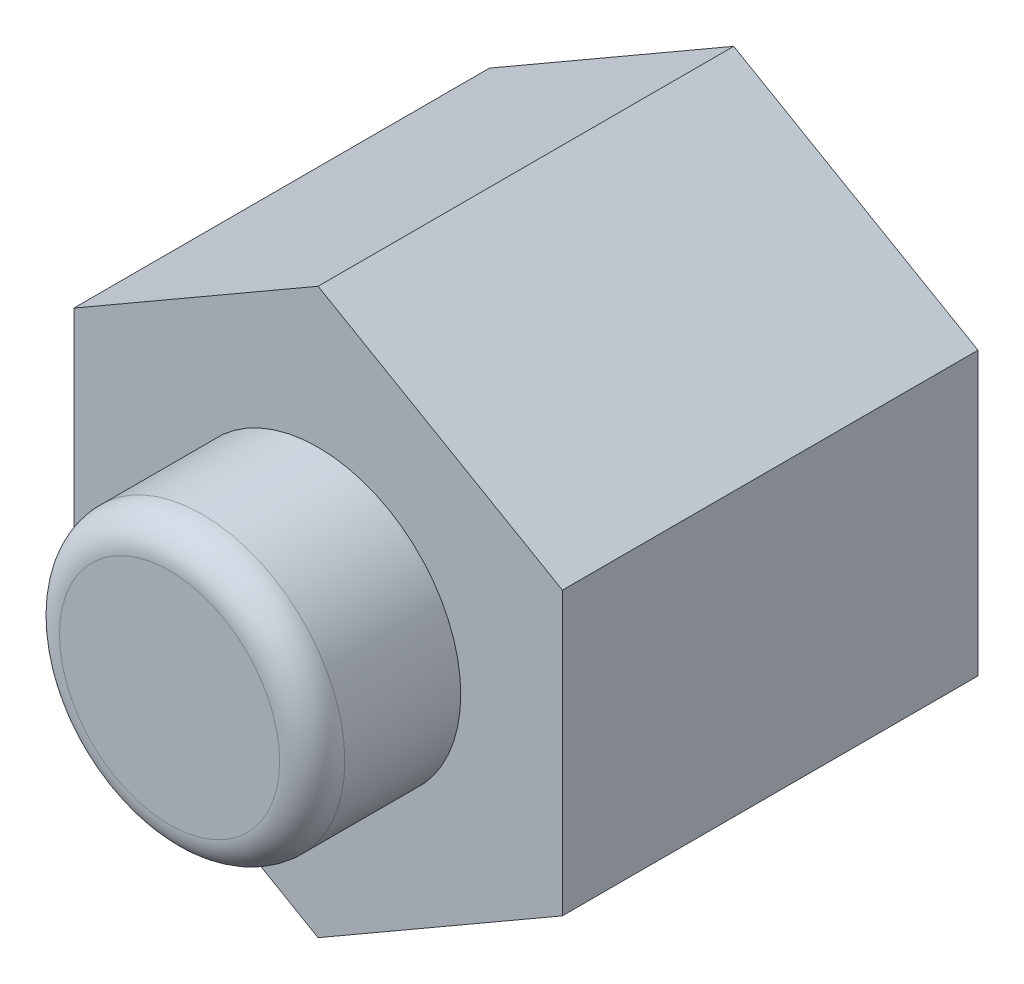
ISO-10303-21;
HEADER;
FILE_DESCRIPTION(('STEP AP214'),'2;1');
FILE_NAME('part.step','',(''),(''),'','','');
FILE_SCHEMA(('AUTOMOTIVE_DESIGN { 1 0 10303 214 1 1 1 1 }'));
ENDSEC;
DATA;
#1=APPLICATION_CONTEXT('core data for automotive mechanical design processes');
#2=APPLICATION_PROTOCOL_DEFINITION('international standard','automotive_design',2000,#1);
#3=PRODUCT_CONTEXT('',#1,'mechanical');
#4=PRODUCT('Part','Part','',(#3));
#5=PRODUCT_RELATED_PRODUCT_CATEGORY('part','',(#4));
#6=PRODUCT_DEFINITION_FORMATION('','',#4);
#7=PRODUCT_DEFINITION_CONTEXT('part definition',#1,'design');
#8=PRODUCT_DEFINITION('design','',#6,#7);
#9=PRODUCT_DEFINITION_SHAPE('','',#8);
#10=(LENGTH_UNIT() NAMED_UNIT(*) SI_UNIT(.MILLI.,.METRE.));
#11=(NAMED_UNIT(*) PLANE_ANGLE_UNIT() SI_UNIT($,.RADIAN.));
#12=(NAMED_UNIT(*) SI_UNIT($,.STERADIAN.) SOLID_ANGLE_UNIT());
#13=UNCERTAINTY_MEASURE_WITH_UNIT(LENGTH_MEASURE(1.E-05),#10,'distance_accuracy_value','');
#14=(GEOMETRIC_REPRESENTATION_CONTEXT(3) GLOBAL_UNCERTAINTY_ASSIGNED_CONTEXT((#13)) GLOBAL_UNIT_ASSIGNED_CONTEXT((#10,
#11,#12)) REPRESENTATION_CONTEXT('',''));
#15=CARTESIAN_POINT('',(0.,0.,0.));
#16=DIRECTION('',(0.,0.,1.));
#17=DIRECTION('',(1.,0.,0.));
#18=AXIS2_PLACEMENT_3D('',#15,#16,#17);
#19=CARTESIAN_POINT('',(0.,0.,24.7141999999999));
#20=DIRECTION('',(0.,0.,1.));
#21=DIRECTION('',(1.,0.,0.));
#22=AXIS2_PLACEMENT_3D('',#19,#20,#21);
#23=PLANE('',#22);
#24=CARTESIAN_POINT('',(0.,0.,24.7141999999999));
#25=DIRECTION('',(0.,0.,-1.));
#26=DIRECTION('',(-1.,0.,0.));
#27=AXIS2_PLACEMENT_3D('',#24,#25,#26);
#28=CIRCLE('',#27,4.2926);
#29=CARTESIAN_POINT('',(-4.2926,0.,24.7141999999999));
#30=VERTEX_POINT('',#29);
#31=CARTESIAN_POINT('',(4.29260000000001,0.,24.7141999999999));
#32=VERTEX_POINT('',#31);
#33=EDGE_CURVE('E78',#30,#32,#28,.T.);
#34=ORIENTED_EDGE('',*,*,#33,.F.);
#35=CARTESIAN_POINT('',(0.,0.,24.7141999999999));
#36=DIRECTION('',(0.,0.,-1.));
#37=DIRECTION('',(1.,0.,0.));
#38=AXIS2_PLACEMENT_3D('',#35,#36,#37);
#39=CIRCLE('',#38,4.29260000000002);
#40=EDGE_CURVE('E76',#32,#30,#39,.T.);
#41=ORIENTED_EDGE('',*,*,#40,.F.);
#42=EDGE_LOOP('',(#34,#41));
#43=FACE_BOUND('',#42,.T.);
#44=ADVANCED_FACE('F17',(#43),#23,.T.);
#45=CARTESIAN_POINT('',(0.,0.,12.7));
#46=DIRECTION('',(0.,0.,-1.));
#47=DIRECTION('',(-1.,0.,0.));
#48=AXIS2_PLACEMENT_3D('',#45,#46,#47);
#49=PLANE('',#48);
#50=CARTESIAN_POINT('',(0.,0.,12.7));
#51=DIRECTION('',(0.,0.,-1.));
#52=DIRECTION('',(-1.,0.,0.));
#53=AXIS2_PLACEMENT_3D('',#50,#51,#52);
#54=CIRCLE('',#53,3.17500000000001);
#55=CARTESIAN_POINT('',(-3.17500000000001,0.,12.7));
#56=VERTEX_POINT('',#55);
#57=EDGE_CURVE('E84',#56,#56,#54,.T.);
#58=ORIENTED_EDGE('',*,*,#57,.T.);
#59=EDGE_LOOP('',(#58));
#60=FACE_BOUND('',#59,.T.);
#61=ADVANCED_FACE('F112',(#60),#49,.T.);
#62=CARTESIAN_POINT('',(0.,0.,23.4441999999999));
#63=DIRECTION('',(0.,0.,1.));
#64=DIRECTION('',(1.,0.,0.));
#65=AXIS2_PLACEMENT_3D('',#62,#63,#64);
#66=TOROIDAL_SURFACE('',#65,4.2926,1.27);
#67=ORIENTED_EDGE('',*,*,#40,.T.);
#68=ORIENTED_EDGE('',*,*,#33,.T.);
#69=EDGE_LOOP('',(#67,#68));
#70=FACE_BOUND('',#69,.T.);
#71=CARTESIAN_POINT('',(0.,0.,23.4441999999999));
#72=DIRECTION('',(0.,0.,-1.));
#73=DIRECTION('',(-1.,0.,0.));
#74=AXIS2_PLACEMENT_3D('',#71,#72,#73);
#75=CIRCLE('',#74,5.56260000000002);
#76=CARTESIAN_POINT('',(-5.56260000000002,0.,23.4441999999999));
#77=VERTEX_POINT('',#76);
#78=EDGE_CURVE('E106',#77,#77,#75,.T.);
#79=ORIENTED_EDGE('',*,*,#78,.F.);
#80=EDGE_LOOP('',(#79));
#81=FACE_BOUND('',#80,.T.);
#82=ADVANCED_FACE('F80',(#70,#81),#66,.T.);
#83=CARTESIAN_POINT('',(0.,0.,12.7));
#84=DIRECTION('',(0.,0.,-1.));
#85=DIRECTION('',(-1.,0.,0.));
#86=AXIS2_PLACEMENT_3D('',#83,#84,#85);
#87=CYLINDRICAL_SURFACE('',#86,3.17500000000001);
#88=ORIENTED_EDGE('',*,*,#57,.F.);
#89=EDGE_LOOP('',(#88));
#90=FACE_BOUND('',#89,.T.);
#91=CARTESIAN_POINT('',(0.,0.,0.));
#92=DIRECTION('',(0.,0.,-1.));
#93=DIRECTION('',(-1.,0.,0.));
#94=AXIS2_PLACEMENT_3D('',#91,#92,#93);
#95=CIRCLE('',#94,3.17500000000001);
#96=CARTESIAN_POINT('',(-3.17500000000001,0.,0.));
#97=VERTEX_POINT('',#96);
#98=EDGE_CURVE('E136',#97,#97,#95,.T.);
#99=ORIENTED_EDGE('',*,*,#98,.T.);
#100=EDGE_LOOP('',(#99));
#101=FACE_BOUND('',#100,.T.);
#102=ADVANCED_FACE('F111',(#90,#101),#87,.F.);
#103=CARTESIAN_POINT('',(0.,0.,24.7141999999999));
#104=DIRECTION('',(0.,0.,-1.));
#105=DIRECTION('',(-1.,0.,0.));
#106=AXIS2_PLACEMENT_3D('',#103,#104,#105);
#107=CYLINDRICAL_SURFACE('',#106,5.56260000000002);
#108=CARTESIAN_POINT('',(0.,0.,18.9229999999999));
#109=DIRECTION('',(0.,0.,-1.));
#110=DIRECTION('',(-1.,0.,0.));
#111=AXIS2_PLACEMENT_3D('',#108,#109,#110);
#112=CIRCLE('',#111,5.56260000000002);
#113=CARTESIAN_POINT('',(-5.56260000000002,0.,18.9229999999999));
#114=VERTEX_POINT('',#113);
#115=EDGE_CURVE('E133',#114,#114,#112,.T.);
#116=ORIENTED_EDGE('',*,*,#115,.F.);
#117=EDGE_LOOP('',(#116));
#118=FACE_BOUND('',#117,.T.);
#119=ORIENTED_EDGE('',*,*,#78,.T.);
#120=EDGE_LOOP('',(#119));
#121=FACE_BOUND('',#120,.T.);
#122=ADVANCED_FACE('F145',(#118,#121),#107,.T.);
#123=CARTESIAN_POINT('',(0.,0.,0.));
#124=DIRECTION('',(0.,0.,1.));
#125=DIRECTION('',(1.,0.,0.));
#126=AXIS2_PLACEMENT_3D('',#123,#124,#125);
#127=PLANE('',#126);
#128=ORIENTED_EDGE('',*,*,#98,.F.);
#129=EDGE_LOOP('',(#128));
#130=FACE_BOUND('',#129,.T.);
#131=CARTESIAN_POINT('',(0.,0.,0.));
#132=DIRECTION('',(0.,0.,1.));
#133=DIRECTION('',(1.,0.,0.));
#134=AXIS2_PLACEMENT_3D('',#131,#132,#133);
#135=CIRCLE('',#134,4.4222045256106);
#136=CARTESIAN_POINT('',(4.4222045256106,0.,0.));
#137=VERTEX_POINT('',#136);
#138=EDGE_CURVE('E129',#137,#137,#135,.T.);
#139=ORIENTED_EDGE('',*,*,#138,.F.);
#140=EDGE_LOOP('',(#139));
#141=FACE_BOUND('',#140,.T.);
#142=ADVANCED_FACE('F147',(#130,#141),#127,.F.);
#143=CARTESIAN_POINT('',(0.,0.,18.9229999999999));
#144=DIRECTION('',(0.,0.,1.));
#145=DIRECTION('',(1.,0.,0.));
#146=AXIS2_PLACEMENT_3D('',#143,#144,#145);
#147=PLANE('',#146);
#148=DIRECTION('',(-0.866025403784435,-0.500000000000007,0.));
#149=VECTOR('',#148,1.);
#150=CARTESIAN_POINT('',(0.,-10.9985226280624,18.9229999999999));
#151=LINE('',#150,#149);
#152=CARTESIAN_POINT('',(0.,-10.9985226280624,18.9229999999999));
#153=VERTEX_POINT('',#152);
#154=CARTESIAN_POINT('',(9.52500000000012,-5.49926131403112,18.9229999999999));
#155=VERTEX_POINT('',#154);
#156=EDGE_CURVE('E215',#153,#155,#151,.F.);
#157=ORIENTED_EDGE('',*,*,#156,.T.);
#158=DIRECTION('',(0.,-1.,0.));
#159=VECTOR('',#158,1.);
#160=CARTESIAN_POINT('',(9.52500000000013,-5.49926131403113,18.9229999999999));
#161=LINE('',#160,#159);
#162=CARTESIAN_POINT('',(9.52500000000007,5.4992613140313,18.9229999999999));
#163=VERTEX_POINT('',#162);
#164=EDGE_CURVE('E217',#155,#163,#161,.F.);
#165=ORIENTED_EDGE('',*,*,#164,.T.);
#166=DIRECTION('',(0.866025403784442,-0.499999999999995,0.));
#167=VECTOR('',#166,1.);
#168=CARTESIAN_POINT('',(9.52500000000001,5.49926131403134,18.9229999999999));
#169=LINE('',#168,#167);
#170=CARTESIAN_POINT('',(0.,10.9985226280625,18.9229999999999));
#171=VERTEX_POINT('',#170);
#172=EDGE_CURVE('E132',#163,#171,#169,.F.);
#173=ORIENTED_EDGE('',*,*,#172,.T.);
#174=DIRECTION('',(0.866025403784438,0.500000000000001,0.));
#175=VECTOR('',#174,1.);
#176=CARTESIAN_POINT('',(0.,10.9985226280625,18.9229999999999));
#177=LINE('',#176,#175);
#178=CARTESIAN_POINT('',(-9.52500000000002,5.49926131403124,18.9229999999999));
#179=VERTEX_POINT('',#178);
#180=EDGE_CURVE('E250',#171,#179,#177,.F.);
#181=ORIENTED_EDGE('',*,*,#180,.T.);
#182=DIRECTION('',(0.,1.,0.));
#183=VECTOR('',#182,1.);
#184=CARTESIAN_POINT('',(-9.52500000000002,5.49926131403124,18.9229999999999));
#185=LINE('',#184,#183);
#186=CARTESIAN_POINT('',(-9.525,-5.49926131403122,18.9229999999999));
#187=VERTEX_POINT('',#186);
#188=EDGE_CURVE('E245',#179,#187,#185,.F.);
#189=ORIENTED_EDGE('',*,*,#188,.T.);
#190=DIRECTION('',(-0.866025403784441,0.499999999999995,0.));
#191=VECTOR('',#190,1.);
#192=CARTESIAN_POINT('',(-9.525,-5.49926131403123,18.9229999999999));
#193=LINE('',#192,#191);
#194=EDGE_CURVE('E219',#187,#153,#193,.F.);
#195=ORIENTED_EDGE('',*,*,#194,.T.);
#196=EDGE_LOOP('',(#157,#165,#173,#181,#189,#195));
#197=FACE_BOUND('',#196,.T.);
#198=ORIENTED_EDGE('',*,*,#115,.T.);
#199=EDGE_LOOP('',(#198));
#200=FACE_BOUND('',#199,.T.);
#201=ADVANCED_FACE('F154',(#197,#200),#147,.T.);
#202=CARTESIAN_POINT('',(0.,0.,1.26999999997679));
#203=DIRECTION('',(0.,0.,1.));
#204=DIRECTION('',(1.,0.,0.));
#205=AXIS2_PLACEMENT_3D('',#202,#203,#204);
#206=CONICAL_SURFACE('',#205,4.76249999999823,0.261799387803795);
#207=ORIENTED_EDGE('',*,*,#138,.T.);
#208=EDGE_LOOP('',(#207));
#209=FACE_BOUND('',#208,.T.);
#210=CARTESIAN_POINT('',(0.,0.,1.27000000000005));
#211=DIRECTION('',(0.,0.,-1.));
#212=DIRECTION('',(-1.,0.,0.));
#213=AXIS2_PLACEMENT_3D('',#210,#211,#212);
#214=CIRCLE('',#213,4.76250000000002);
#215=CARTESIAN_POINT('',(-4.76250000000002,0.,1.27000000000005));
#216=VERTEX_POINT('',#215);
#217=EDGE_CURVE('E227',#216,#216,#214,.F.);
#218=ORIENTED_EDGE('',*,*,#217,.F.);
#219=EDGE_LOOP('',(#218));
#220=FACE_BOUND('',#219,.T.);
#221=ADVANCED_FACE('F202',(#209,#220),#206,.T.);
#222=CARTESIAN_POINT('',(9.52500000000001,5.49926131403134,18.9229999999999));
#223=DIRECTION('',(-0.499999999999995,-0.866025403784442,0.));
#224=DIRECTION('',(0.866025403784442,-0.499999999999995,0.));
#225=AXIS2_PLACEMENT_3D('',#222,#223,#224);
#226=PLANE('',#225);
#227=DIRECTION('',(-0.866025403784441,0.499999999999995,0.));
#228=VECTOR('',#227,1.);
#229=CARTESIAN_POINT('',(9.52500000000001,5.49926131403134,2.71779999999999));
#230=LINE('',#229,#228);
#231=CARTESIAN_POINT('',(9.52500000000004,5.49926131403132,2.71779999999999));
#232=VERTEX_POINT('',#231);
#233=CARTESIAN_POINT('',(0.,10.9985226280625,2.71779999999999));
#234=VERTEX_POINT('',#233);
#235=EDGE_CURVE('E231',#232,#234,#230,.T.);
#236=ORIENTED_EDGE('',*,*,#235,.T.);
#237=DIRECTION('',(0.,0.,1.));
#238=VECTOR('',#237,1.);
#239=CARTESIAN_POINT('',(0.,10.9985226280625,18.9229999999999));
#240=LINE('',#239,#238);
#241=EDGE_CURVE('E247',#234,#171,#240,.T.);
#242=ORIENTED_EDGE('',*,*,#241,.T.);
#243=ORIENTED_EDGE('',*,*,#172,.F.);
#244=DIRECTION('',(0.,0.,1.));
#245=VECTOR('',#244,1.);
#246=CARTESIAN_POINT('',(9.52500000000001,5.49926131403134,18.9229999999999));
#247=LINE('',#246,#245);
#248=EDGE_CURVE('E228',#163,#232,#247,.F.);
#249=ORIENTED_EDGE('',*,*,#248,.T.);
#250=EDGE_LOOP('',(#236,#242,#243,#249));
#251=FACE_BOUND('',#250,.T.);
#252=ADVANCED_FACE('F198',(#251),#226,.F.);
#253=CARTESIAN_POINT('',(0.,10.9985226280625,18.9229999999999));
#254=DIRECTION('',(0.500000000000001,-0.866025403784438,0.));
#255=DIRECTION('',(0.866025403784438,0.500000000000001,0.));
#256=AXIS2_PLACEMENT_3D('',#253,#254,#255);
#257=PLANE('',#256);
#258=DIRECTION('',(-0.866025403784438,-0.500000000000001,0.));
#259=VECTOR('',#258,1.);
#260=CARTESIAN_POINT('',(0.,10.9985226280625,2.71779999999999));
#261=LINE('',#260,#259);
#262=CARTESIAN_POINT('',(-9.52500000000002,5.49926131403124,2.71779999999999));
#263=VERTEX_POINT('',#262);
#264=EDGE_CURVE('E257',#234,#263,#261,.T.);
#265=ORIENTED_EDGE('',*,*,#264,.T.);
#266=DIRECTION('',(0.,0.,1.));
#267=VECTOR('',#266,1.);
#268=CARTESIAN_POINT('',(-9.52500000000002,5.49926131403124,18.9229999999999));
#269=LINE('',#268,#267);
#270=EDGE_CURVE('E242',#263,#179,#269,.T.);
#271=ORIENTED_EDGE('',*,*,#270,.T.);
#272=ORIENTED_EDGE('',*,*,#180,.F.);
#273=ORIENTED_EDGE('',*,*,#241,.F.);
#274=EDGE_LOOP('',(#265,#271,#272,#273));
#275=FACE_BOUND('',#274,.T.);
#276=ADVANCED_FACE('F194',(#275),#257,.F.);
#277=CARTESIAN_POINT('',(-9.52500000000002,5.49926131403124,18.9229999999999));
#278=DIRECTION('',(1.,0.,0.));
#279=DIRECTION('',(0.,1.,0.));
#280=AXIS2_PLACEMENT_3D('',#277,#278,#279);
#281=PLANE('',#280);
#282=DIRECTION('',(0.,1.,0.));
#283=VECTOR('',#282,1.);
#284=CARTESIAN_POINT('',(-9.52500000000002,0.,2.71779999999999));
#285=LINE('',#284,#283);
#286=CARTESIAN_POINT('',(-9.525,-5.49926131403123,2.71779999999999));
#287=VERTEX_POINT('',#286);
#288=EDGE_CURVE('E262',#263,#287,#285,.F.);
#289=ORIENTED_EDGE('',*,*,#288,.T.);
#290=DIRECTION('',(0.,0.,1.));
#291=VECTOR('',#290,1.);
#292=CARTESIAN_POINT('',(-9.525,-5.49926131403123,18.9229999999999));
#293=LINE('',#292,#291);
#294=EDGE_CURVE('E222',#287,#187,#293,.T.);
#295=ORIENTED_EDGE('',*,*,#294,.T.);
#296=ORIENTED_EDGE('',*,*,#188,.F.);
#297=ORIENTED_EDGE('',*,*,#270,.F.);
#298=EDGE_LOOP('',(#289,#295,#296,#297));
#299=FACE_BOUND('',#298,.T.);
#300=ADVANCED_FACE('F190',(#299),#281,.F.);
#301=CARTESIAN_POINT('',(-9.525,-5.49926131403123,18.9229999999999));
#302=DIRECTION('',(0.499999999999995,0.866025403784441,0.));
#303=DIRECTION('',(-0.866025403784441,0.499999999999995,0.));
#304=AXIS2_PLACEMENT_3D('',#301,#302,#303);
#305=PLANE('',#304);
#306=DIRECTION('',(0.866025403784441,-0.499999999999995,0.));
#307=VECTOR('',#306,1.);
#308=CARTESIAN_POINT('',(-9.525,-5.49926131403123,2.71779999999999));
#309=LINE('',#308,#307);
#310=CARTESIAN_POINT('',(0.,-10.9985226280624,2.71779999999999));
#311=VERTEX_POINT('',#310);
#312=EDGE_CURVE('E263',#287,#311,#309,.T.);
#313=ORIENTED_EDGE('',*,*,#312,.T.);
#314=DIRECTION('',(0.,0.,1.));
#315=VECTOR('',#314,1.);
#316=CARTESIAN_POINT('',(0.,-10.9985226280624,18.9229999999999));
#317=LINE('',#316,#315);
#318=EDGE_CURVE('E221',#311,#153,#317,.T.);
#319=ORIENTED_EDGE('',*,*,#318,.T.);
#320=ORIENTED_EDGE('',*,*,#194,.F.);
#321=ORIENTED_EDGE('',*,*,#294,.F.);
#322=EDGE_LOOP('',(#313,#319,#320,#321));
#323=FACE_BOUND('',#322,.T.);
#324=ADVANCED_FACE('F186',(#323),#305,.F.);
#325=CARTESIAN_POINT('',(0.,-10.9985226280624,18.9229999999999));
#326=DIRECTION('',(-0.500000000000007,0.866025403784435,0.));
#327=DIRECTION('',(-0.866025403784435,-0.500000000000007,0.));
#328=AXIS2_PLACEMENT_3D('',#325,#326,#327);
#329=PLANE('',#328);
#330=DIRECTION('',(0.866025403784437,0.500000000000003,0.));
#331=VECTOR('',#330,1.);
#332=CARTESIAN_POINT('',(0.,-10.9985226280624,2.71779999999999));
#333=LINE('',#332,#331);
#334=CARTESIAN_POINT('',(9.52500000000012,-5.49926131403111,2.71779999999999));
#335=VERTEX_POINT('',#334);
#336=EDGE_CURVE('E226',#311,#335,#333,.T.);
#337=ORIENTED_EDGE('',*,*,#336,.T.);
#338=DIRECTION('',(0.,0.,1.));
#339=VECTOR('',#338,1.);
#340=CARTESIAN_POINT('',(9.52500000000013,-5.49926131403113,18.9229999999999));
#341=LINE('',#340,#339);
#342=EDGE_CURVE('E38',#335,#155,#341,.T.);
#343=ORIENTED_EDGE('',*,*,#342,.T.);
#344=ORIENTED_EDGE('',*,*,#156,.F.);
#345=ORIENTED_EDGE('',*,*,#318,.F.);
#346=EDGE_LOOP('',(#337,#343,#344,#345));
#347=FACE_BOUND('',#346,.T.);
#348=ADVANCED_FACE('F183',(#347),#329,.F.);
#349=CARTESIAN_POINT('',(9.52500000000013,-5.49926131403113,18.9229999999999));
#350=DIRECTION('',(-1.,0.,0.));
#351=DIRECTION('',(0.,-1.,0.));
#352=AXIS2_PLACEMENT_3D('',#349,#350,#351);
#353=PLANE('',#352);
#354=DIRECTION('',(0.,1.,0.));
#355=VECTOR('',#354,1.);
#356=CARTESIAN_POINT('',(9.52500000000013,0.,2.71779999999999));
#357=LINE('',#356,#355);
#358=EDGE_CURVE('E128',#335,#232,#357,.T.);
#359=ORIENTED_EDGE('',*,*,#358,.T.);
#360=ORIENTED_EDGE('',*,*,#248,.F.);
#361=ORIENTED_EDGE('',*,*,#164,.F.);
#362=ORIENTED_EDGE('',*,*,#342,.F.);
#363=EDGE_LOOP('',(#359,#360,#361,#362));
#364=FACE_BOUND('',#363,.T.);
#365=ADVANCED_FACE('F179',(#364),#353,.F.);
#366=CARTESIAN_POINT('',(0.,0.,15.875));
#367=DIRECTION('',(0.,0.,-1.));
#368=DIRECTION('',(-1.,0.,0.));
#369=AXIS2_PLACEMENT_3D('',#366,#367,#368);
#370=CYLINDRICAL_SURFACE('',#369,4.76250000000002);
#371=CARTESIAN_POINT('',(0.,0.,15.875));
#372=DIRECTION('',(0.,0.,-1.));
#373=DIRECTION('',(-1.,0.,0.));
#374=AXIS2_PLACEMENT_3D('',#371,#372,#373);
#375=CIRCLE('',#374,4.76250000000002);
#376=CARTESIAN_POINT('',(-4.76250000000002,0.,15.875));
#377=VERTEX_POINT('',#376);
#378=EDGE_CURVE('E125',#377,#377,#375,.F.);
#379=ORIENTED_EDGE('',*,*,#378,.F.);
#380=EDGE_LOOP('',(#379));
#381=FACE_BOUND('',#380,.T.);
#382=ORIENTED_EDGE('',*,*,#217,.T.);
#383=EDGE_LOOP('',(#382));
#384=FACE_BOUND('',#383,.T.);
#385=ADVANCED_FACE('F175',(#381,#384),#370,.T.);
#386=CARTESIAN_POINT('',(0.,0.,2.71779999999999));
#387=DIRECTION('',(0.,0.,1.));
#388=DIRECTION('',(1.,0.,0.));
#389=AXIS2_PLACEMENT_3D('',#386,#387,#388);
#390=PLANE('',#389);
#391=ORIENTED_EDGE('',*,*,#336,.F.);
#392=ORIENTED_EDGE('',*,*,#312,.F.);
#393=ORIENTED_EDGE('',*,*,#288,.F.);
#394=ORIENTED_EDGE('',*,*,#264,.F.);
#395=ORIENTED_EDGE('',*,*,#235,.F.);
#396=ORIENTED_EDGE('',*,*,#358,.F.);
#397=EDGE_LOOP('',(#391,#392,#393,#394,#395,#396));
#398=FACE_BOUND('',#397,.T.);
#399=CARTESIAN_POINT('',(0.,0.,2.71779999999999));
#400=DIRECTION('',(0.,0.,-1.));
#401=DIRECTION('',(-1.,0.,0.));
#402=AXIS2_PLACEMENT_3D('',#399,#400,#401);
#403=CIRCLE('',#402,7.14375000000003);
#404=CARTESIAN_POINT('',(-7.14375000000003,0.,2.71779999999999));
#405=VERTEX_POINT('',#404);
#406=EDGE_CURVE('E29',#405,#405,#403,.F.);
#407=ORIENTED_EDGE('',*,*,#406,.T.);
#408=EDGE_LOOP('',(#407));
#409=FACE_BOUND('',#408,.T.);
#410=ADVANCED_FACE('F167',(#398,#409),#390,.F.);
#411=CARTESIAN_POINT('',(0.,0.,15.875));
#412=DIRECTION('',(0.,0.,-1.));
#413=DIRECTION('',(-1.,0.,0.));
#414=AXIS2_PLACEMENT_3D('',#411,#412,#413);
#415=PLANE('',#414);
#416=CARTESIAN_POINT('',(0.,0.,15.875));
#417=DIRECTION('',(0.,0.,-1.));
#418=DIRECTION('',(-1.,0.,0.));
#419=AXIS2_PLACEMENT_3D('',#416,#417,#418);
#420=CIRCLE('',#419,7.14375000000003);
#421=CARTESIAN_POINT('',(-7.14375000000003,0.,15.875));
#422=VERTEX_POINT('',#421);
#423=EDGE_CURVE('E11',#422,#422,#420,.T.);
#424=ORIENTED_EDGE('',*,*,#423,.T.);
#425=EDGE_LOOP('',(#424));
#426=FACE_BOUND('',#425,.T.);
#427=ORIENTED_EDGE('',*,*,#378,.T.);
#428=EDGE_LOOP('',(#427));
#429=FACE_BOUND('',#428,.T.);
#430=ADVANCED_FACE('F161',(#426,#429),#415,.T.);
#431=CARTESIAN_POINT('',(0.,0.,15.875));
#432=DIRECTION('',(0.,0.,-1.));
#433=DIRECTION('',(-1.,0.,0.));
#434=AXIS2_PLACEMENT_3D('',#431,#432,#433);
#435=CYLINDRICAL_SURFACE('',#434,7.14375000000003);
#436=ORIENTED_EDGE('',*,*,#406,.F.);
#437=EDGE_LOOP('',(#436));
#438=FACE_BOUND('',#437,.T.);
#439=ORIENTED_EDGE('',*,*,#423,.F.);
#440=EDGE_LOOP('',(#439));
#441=FACE_BOUND('',#440,.T.);
#442=ADVANCED_FACE('F159',(#438,#441),#435,.F.);
#443=CLOSED_SHELL('',(#44,#61,#82,#102,#122,#142,#201,#221,#252,#276,#300,#324,#348,#365,#385,
#410,#430,#442));
#444=MANIFOLD_SOLID_BREP('B1',#443);
#445=ADVANCED_BREP_SHAPE_REPRESENTATION('',(#18,#444),#14);
#446=SHAPE_DEFINITION_REPRESENTATION(#9,#445);
ENDSEC;
END-ISO-10303-21;
